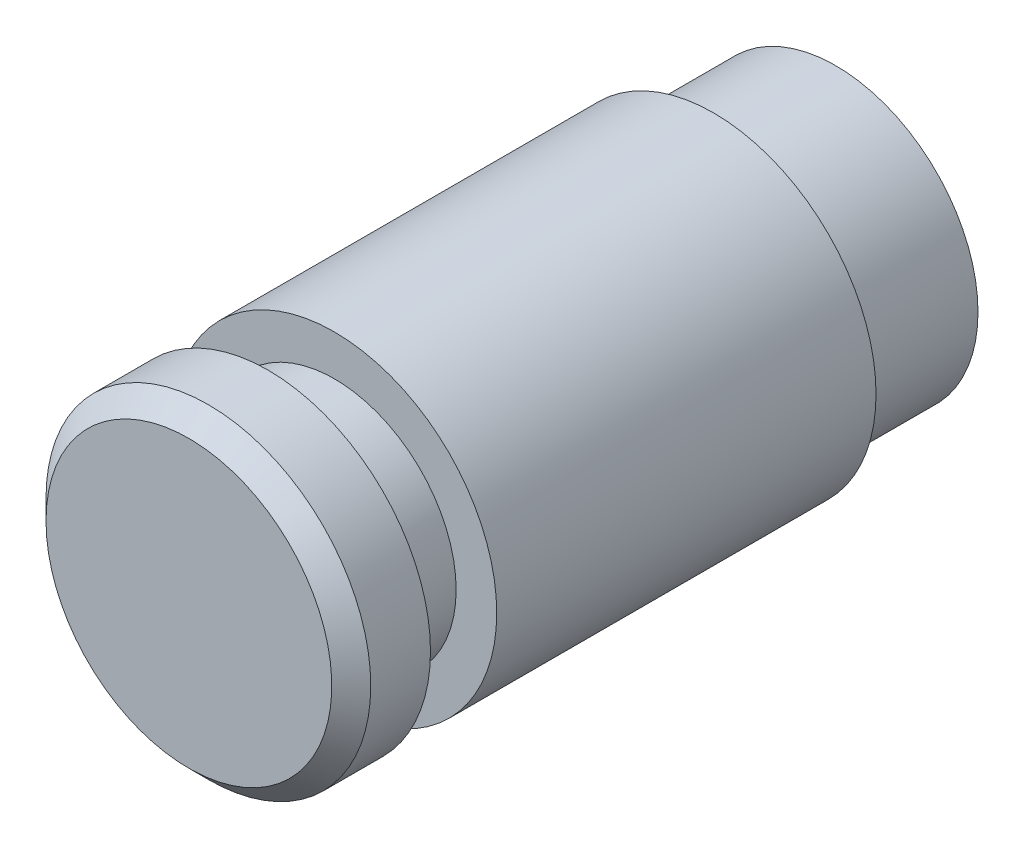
ISO-10303-21;
HEADER;
FILE_DESCRIPTION(('STEP AP214'),'2;1');
FILE_NAME('part.step','',(''),(''),'','','');
FILE_SCHEMA(('AUTOMOTIVE_DESIGN { 1 0 10303 214 1 1 1 1 }'));
ENDSEC;
DATA;
#1=APPLICATION_CONTEXT('core data for automotive mechanical design processes');
#2=APPLICATION_PROTOCOL_DEFINITION('international standard','automotive_design',2000,#1);
#3=PRODUCT_CONTEXT('',#1,'mechanical');
#4=PRODUCT('Part','Part','',(#3));
#5=PRODUCT_RELATED_PRODUCT_CATEGORY('part','',(#4));
#6=PRODUCT_DEFINITION_FORMATION('','',#4);
#7=PRODUCT_DEFINITION_CONTEXT('part definition',#1,'design');
#8=PRODUCT_DEFINITION('design','',#6,#7);
#9=PRODUCT_DEFINITION_SHAPE('','',#8);
#10=(LENGTH_UNIT() NAMED_UNIT(*) SI_UNIT(.MILLI.,.METRE.));
#11=(NAMED_UNIT(*) PLANE_ANGLE_UNIT() SI_UNIT($,.RADIAN.));
#12=(NAMED_UNIT(*) SI_UNIT($,.STERADIAN.) SOLID_ANGLE_UNIT());
#13=UNCERTAINTY_MEASURE_WITH_UNIT(LENGTH_MEASURE(1.E-05),#10,'distance_accuracy_value','');
#14=(GEOMETRIC_REPRESENTATION_CONTEXT(3) GLOBAL_UNCERTAINTY_ASSIGNED_CONTEXT((#13)) GLOBAL_UNIT_ASSIGNED_CONTEXT((#10,
#11,#12)) REPRESENTATION_CONTEXT('',''));
#15=CARTESIAN_POINT('',(0.,0.,0.));
#16=DIRECTION('',(0.,0.,1.));
#17=DIRECTION('',(1.,0.,0.));
#18=AXIS2_PLACEMENT_3D('',#15,#16,#17);
#19=CARTESIAN_POINT('',(0.,0.,-2.3876));
#20=DIRECTION('',(0.,0.,1.));
#21=DIRECTION('',(1.,0.,0.));
#22=AXIS2_PLACEMENT_3D('',#19,#20,#21);
#23=CYLINDRICAL_SURFACE('',#22,2.7813);
#24=CARTESIAN_POINT('',(0.,0.,-2.3876));
#25=DIRECTION('',(0.,0.,1.));
#26=DIRECTION('',(1.,0.,0.));
#27=AXIS2_PLACEMENT_3D('',#24,#25,#26);
#28=CIRCLE('',#27,2.7813);
#29=CARTESIAN_POINT('',(2.7813,0.,-2.3876));
#30=VERTEX_POINT('',#29);
#31=EDGE_CURVE('E44',#30,#30,#28,.T.);
#32=ORIENTED_EDGE('',*,*,#31,.T.);
#33=EDGE_LOOP('',(#32));
#34=FACE_BOUND('',#33,.T.);
#35=CARTESIAN_POINT('',(0.,0.,0.));
#36=DIRECTION('',(0.,0.,1.));
#37=DIRECTION('',(1.,0.,0.));
#38=AXIS2_PLACEMENT_3D('',#35,#36,#37);
#39=CIRCLE('',#38,2.7813);
#40=CARTESIAN_POINT('',(2.7813,0.,0.));
#41=VERTEX_POINT('',#40);
#42=EDGE_CURVE('E48',#41,#41,#39,.T.);
#43=ORIENTED_EDGE('',*,*,#42,.F.);
#44=EDGE_LOOP('',(#43));
#45=FACE_BOUND('',#44,.T.);
#46=ADVANCED_FACE('F33',(#34,#45),#23,.T.);
#47=CARTESIAN_POINT('',(0.,0.,-2.3876));
#48=DIRECTION('',(0.,0.,1.));
#49=DIRECTION('',(1.,0.,0.));
#50=AXIS2_PLACEMENT_3D('',#47,#48,#49);
#51=PLANE('',#50);
#52=ORIENTED_EDGE('',*,*,#31,.F.);
#53=EDGE_LOOP('',(#52));
#54=FACE_BOUND('',#53,.T.);
#55=ADVANCED_FACE('F84',(#54),#51,.F.);
#56=CARTESIAN_POINT('',(0.,0.,10.2616));
#57=DIRECTION('',(0.,0.,-1.));
#58=DIRECTION('',(-1.,0.,0.));
#59=AXIS2_PLACEMENT_3D('',#56,#57,#58);
#60=CYLINDRICAL_SURFACE('',#59,3.175);
#61=CARTESIAN_POINT('',(0.,0.,7.4168));
#62=DIRECTION('',(0.,0.,-1.));
#63=DIRECTION('',(-1.,0.,0.));
#64=AXIS2_PLACEMENT_3D('',#61,#62,#63);
#65=CIRCLE('',#64,3.175);
#66=CARTESIAN_POINT('',(-3.175,0.,7.4168));
#67=VERTEX_POINT('',#66);
#68=EDGE_CURVE('E62',#67,#67,#65,.T.);
#69=ORIENTED_EDGE('',*,*,#68,.T.);
#70=EDGE_LOOP('',(#69));
#71=FACE_BOUND('',#70,.T.);
#72=CARTESIAN_POINT('',(0.,0.,0.));
#73=DIRECTION('',(0.,0.,1.));
#74=DIRECTION('',(1.,0.,0.));
#75=AXIS2_PLACEMENT_3D('',#72,#73,#74);
#76=CIRCLE('',#75,3.175);
#77=CARTESIAN_POINT('',(3.175,0.,0.));
#78=VERTEX_POINT('',#77);
#79=EDGE_CURVE('E52',#78,#78,#76,.T.);
#80=ORIENTED_EDGE('',*,*,#79,.T.);
#81=EDGE_LOOP('',(#80));
#82=FACE_BOUND('',#81,.T.);
#83=ADVANCED_FACE('F74',(#71,#82),#60,.T.);
#84=CARTESIAN_POINT('',(0.,0.,0.));
#85=DIRECTION('',(0.,0.,1.));
#86=DIRECTION('',(1.,0.,0.));
#87=AXIS2_PLACEMENT_3D('',#84,#85,#86);
#88=PLANE('',#87);
#89=ORIENTED_EDGE('',*,*,#42,.T.);
#90=EDGE_LOOP('',(#89));
#91=FACE_BOUND('',#90,.T.);
#92=ORIENTED_EDGE('',*,*,#79,.F.);
#93=EDGE_LOOP('',(#92));
#94=FACE_BOUND('',#93,.T.);
#95=ADVANCED_FACE('F83',(#91,#94),#88,.F.);
#96=CARTESIAN_POINT('',(0.,3.175,8.7122));
#97=DIRECTION('',(0.,0.,1.));
#98=DIRECTION('',(1.,0.,0.));
#99=AXIS2_PLACEMENT_3D('',#96,#97,#98);
#100=PLANE('',#99);
#101=CARTESIAN_POINT('',(0.,0.,8.7122));
#102=DIRECTION('',(0.,0.,-1.));
#103=DIRECTION('',(-1.,0.,0.));
#104=AXIS2_PLACEMENT_3D('',#101,#102,#103);
#105=CIRCLE('',#104,2.38125);
#106=CARTESIAN_POINT('',(-2.38125,0.,8.7122));
#107=VERTEX_POINT('',#106);
#108=EDGE_CURVE('E56',#107,#107,#105,.T.);
#109=ORIENTED_EDGE('',*,*,#108,.F.);
#110=EDGE_LOOP('',(#109));
#111=FACE_BOUND('',#110,.T.);
#112=CARTESIAN_POINT('',(0.,0.,8.7122));
#113=DIRECTION('',(0.,0.,-1.));
#114=DIRECTION('',(-1.,0.,0.));
#115=AXIS2_PLACEMENT_3D('',#112,#113,#114);
#116=CIRCLE('',#115,3.175);
#117=CARTESIAN_POINT('',(-3.175,0.,8.7122));
#118=VERTEX_POINT('',#117);
#119=EDGE_CURVE('E65',#118,#118,#116,.T.);
#120=ORIENTED_EDGE('',*,*,#119,.T.);
#121=EDGE_LOOP('',(#120));
#122=FACE_BOUND('',#121,.T.);
#123=ADVANCED_FACE('F69',(#111,#122),#100,.F.);
#124=CARTESIAN_POINT('',(0.,0.,0.));
#125=DIRECTION('',(0.,0.,-1.));
#126=DIRECTION('',(-1.,0.,0.));
#127=AXIS2_PLACEMENT_3D('',#124,#125,#126);
#128=CYLINDRICAL_SURFACE('',#127,2.38125);
#129=CARTESIAN_POINT('',(0.,0.,7.4168));
#130=DIRECTION('',(0.,0.,-1.));
#131=DIRECTION('',(-1.,0.,0.));
#132=AXIS2_PLACEMENT_3D('',#129,#130,#131);
#133=CIRCLE('',#132,2.38125);
#134=CARTESIAN_POINT('',(-2.38125,0.,7.4168));
#135=VERTEX_POINT('',#134);
#136=EDGE_CURVE('E59',#135,#135,#133,.T.);
#137=ORIENTED_EDGE('',*,*,#136,.F.);
#138=EDGE_LOOP('',(#137));
#139=FACE_BOUND('',#138,.T.);
#140=ORIENTED_EDGE('',*,*,#108,.T.);
#141=EDGE_LOOP('',(#140));
#142=FACE_BOUND('',#141,.T.);
#143=ADVANCED_FACE('F103',(#139,#142),#128,.T.);
#144=CARTESIAN_POINT('',(0.,3.175,7.4168));
#145=DIRECTION('',(0.,0.,-1.));
#146=DIRECTION('',(-1.,0.,0.));
#147=AXIS2_PLACEMENT_3D('',#144,#145,#146);
#148=PLANE('',#147);
#149=ORIENTED_EDGE('',*,*,#68,.F.);
#150=EDGE_LOOP('',(#149));
#151=FACE_BOUND('',#150,.T.);
#152=ORIENTED_EDGE('',*,*,#136,.T.);
#153=EDGE_LOOP('',(#152));
#154=FACE_BOUND('',#153,.T.);
#155=ADVANCED_FACE('F108',(#151,#154),#148,.F.);
#156=CARTESIAN_POINT('',(0.,0.,10.2616));
#157=DIRECTION('',(0.,0.,1.));
#158=DIRECTION('',(1.,0.,0.));
#159=AXIS2_PLACEMENT_3D('',#156,#157,#158);
#160=PLANE('',#159);
#161=CARTESIAN_POINT('',(0.,0.,10.2616));
#162=DIRECTION('',(0.,0.,1.));
#163=DIRECTION('',(1.,0.,0.));
#164=AXIS2_PLACEMENT_3D('',#161,#162,#163);
#165=CIRCLE('',#164,2.794);
#166=CARTESIAN_POINT('',(-2.794,0.,10.2616));
#167=VERTEX_POINT('',#166);
#168=EDGE_CURVE('E40',#167,#167,#165,.T.);
#169=ORIENTED_EDGE('',*,*,#168,.T.);
#170=EDGE_LOOP('',(#169));
#171=FACE_BOUND('',#170,.T.);
#172=ADVANCED_FACE('F78',(#171),#160,.T.);
#173=CARTESIAN_POINT('',(0.,0.,10.2616));
#174=DIRECTION('',(0.,0.,-1.));
#175=DIRECTION('',(-1.,0.,0.));
#176=AXIS2_PLACEMENT_3D('',#173,#174,#175);
#177=CONICAL_SURFACE('',#176,2.794,0.785398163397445);
#178=CARTESIAN_POINT('',(0.,0.,9.88059999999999));
#179=DIRECTION('',(0.,0.,1.));
#180=DIRECTION('',(1.,0.,0.));
#181=AXIS2_PLACEMENT_3D('',#178,#179,#180);
#182=CIRCLE('',#181,3.175);
#183=CARTESIAN_POINT('',(-3.175,0.,9.88059999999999));
#184=VERTEX_POINT('',#183);
#185=EDGE_CURVE('E10',#184,#184,#182,.F.);
#186=CARTESIAN_POINT('',(-3.175,0.,9.88059999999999));
#187=CARTESIAN_POINT('',(-3.17103125,0.,9.88456874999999));
#188=CARTESIAN_POINT('',(-3.1670625,0.,9.88853749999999));
#189=CARTESIAN_POINT('',(-3.159125,0.,9.89647499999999));
#190=CARTESIAN_POINT('',(-3.15515625,0.,9.90044374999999));
#191=CARTESIAN_POINT('',(-3.14721875,0.,9.90838124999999));
#192=CARTESIAN_POINT('',(-3.14325,0.,9.91234999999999));
#193=CARTESIAN_POINT('',(-3.1353125,0.,9.9202875));
#194=CARTESIAN_POINT('',(-3.13134375,0.,9.92425625));
#195=CARTESIAN_POINT('',(-3.12340625,0.,9.93219374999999));
#196=CARTESIAN_POINT('',(-3.1194375,0.,9.93616249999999));
#197=CARTESIAN_POINT('',(-3.1115,0.,9.94409999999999));
#198=CARTESIAN_POINT('',(-3.10753125,0.,9.94806875));
#199=CARTESIAN_POINT('',(-3.09959375,0.,9.95600624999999));
#200=CARTESIAN_POINT('',(-3.095625,0.,9.959975));
#201=CARTESIAN_POINT('',(-3.0876875,0.,9.9679125));
#202=CARTESIAN_POINT('',(-3.08371875,0.,9.97188125));
#203=CARTESIAN_POINT('',(-3.07578125,0.,9.97981875));
#204=CARTESIAN_POINT('',(-3.0718125,0.,9.98378749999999));
#205=CARTESIAN_POINT('',(-3.063875,0.,9.991725));
#206=CARTESIAN_POINT('',(-3.05990625,0.,9.99569375));
#207=CARTESIAN_POINT('',(-3.05196875,0.,10.00363125));
#208=CARTESIAN_POINT('',(-3.048,0.,10.0076));
#209=CARTESIAN_POINT('',(-3.0400625,0.,10.0155375));
#210=CARTESIAN_POINT('',(-3.03609375,0.,10.01950625));
#211=CARTESIAN_POINT('',(-3.02815625,0.,10.02744375));
#212=CARTESIAN_POINT('',(-3.0241875,0.,10.0314125));
#213=CARTESIAN_POINT('',(-3.01625,0.,10.03935));
#214=CARTESIAN_POINT('',(-3.01228125,0.,10.04331875));
#215=CARTESIAN_POINT('',(-3.00434375,0.,10.05125625));
#216=CARTESIAN_POINT('',(-3.000375,0.,10.055225));
#217=CARTESIAN_POINT('',(-2.9924375,0.,10.0631625));
#218=CARTESIAN_POINT('',(-2.98846875,0.,10.06713125));
#219=CARTESIAN_POINT('',(-2.98053125,0.,10.07506875));
#220=CARTESIAN_POINT('',(-2.9765625,0.,10.0790375));
#221=CARTESIAN_POINT('',(-2.968625,0.,10.086975));
#222=CARTESIAN_POINT('',(-2.96465625,0.,10.09094375));
#223=CARTESIAN_POINT('',(-2.95671875,0.,10.09888125));
#224=CARTESIAN_POINT('',(-2.95275,0.,10.10285));
#225=CARTESIAN_POINT('',(-2.9448125,0.,10.1107875));
#226=CARTESIAN_POINT('',(-2.94084375,0.,10.11475625));
#227=CARTESIAN_POINT('',(-2.93290625,0.,10.12269375));
#228=CARTESIAN_POINT('',(-2.9289375,0.,10.1266625));
#229=CARTESIAN_POINT('',(-2.921,0.,10.1346));
#230=CARTESIAN_POINT('',(-2.91703125,0.,10.13856875));
#231=CARTESIAN_POINT('',(-2.90909375,0.,10.14650625));
#232=CARTESIAN_POINT('',(-2.905125,0.,10.150475));
#233=CARTESIAN_POINT('',(-2.8971875,0.,10.1584125));
#234=CARTESIAN_POINT('',(-2.89321875,0.,10.16238125));
#235=CARTESIAN_POINT('',(-2.88528125,0.,10.17031875));
#236=CARTESIAN_POINT('',(-2.8813125,0.,10.1742875));
#237=CARTESIAN_POINT('',(-2.873375,0.,10.182225));
#238=CARTESIAN_POINT('',(-2.86940625,0.,10.18619375));
#239=CARTESIAN_POINT('',(-2.86146875,0.,10.19413125));
#240=CARTESIAN_POINT('',(-2.8575,0.,10.1981));
#241=CARTESIAN_POINT('',(-2.8495625,0.,10.2060375));
#242=CARTESIAN_POINT('',(-2.84559375,0.,10.21000625));
#243=CARTESIAN_POINT('',(-2.83765625,0.,10.21794375));
#244=CARTESIAN_POINT('',(-2.8336875,0.,10.2219125));
#245=CARTESIAN_POINT('',(-2.82575,0.,10.22985));
#246=CARTESIAN_POINT('',(-2.82178125,0.,10.23381875));
#247=CARTESIAN_POINT('',(-2.81384375,0.,10.24175625));
#248=CARTESIAN_POINT('',(-2.809875,0.,10.245725));
#249=CARTESIAN_POINT('',(-2.8019375,0.,10.2536625));
#250=CARTESIAN_POINT('',(-2.79796875,0.,10.25763125));
#251=CARTESIAN_POINT('',(-2.794,0.,10.2616));
#252=B_SPLINE_CURVE_WITH_KNOTS('',3,(#186,#187,#188,#189,#190,#191,#192,#193,#194,#195,#196,
#197,#198,#199,#200,#201,#202,#203,#204,#205,#206,#207,#208,#209,#210,#211,#212,#213,#214,#215,
#216,#217,#218,#219,#220,#221,#222,#223,#224,#225,#226,#227,#228,#229,#230,#231,#232,#233,#234,
#235,#236,#237,#238,#239,#240,#241,#242,#243,#244,#245,#246,#247,#248,#249,#250,#251),
.UNSPECIFIED.,.F.,.F.,(4,2,2,2,2,2,2,2,2,2,2,2,2,2,2,2,2,2,2,2,2,2,2,2,2,2,2,2,2,2,2,2,4),(0.,
0.016837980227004,0.0336759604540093,0.0505139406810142,0.0673519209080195,0.0841899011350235,
0.101027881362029,0.117865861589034,0.134703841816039,0.151541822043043,0.168379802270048,
0.185217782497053,0.202055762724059,0.218893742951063,0.235731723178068,0.252569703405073,
0.269407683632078,0.286245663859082,0.303083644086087,0.319921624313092,0.336759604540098,
0.353597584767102,0.370435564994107,0.387273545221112,0.404111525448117,0.420949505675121,
0.437787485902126,0.454625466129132,0.471463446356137,0.488301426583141,0.505139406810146,
0.521977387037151,0.538815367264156),.UNSPECIFIED.);
#253=EDGE_CURVE('BSEAM35',#184,#167,#252,.T.);
#254=ORIENTED_EDGE('',*,*,#185,.F.);
#255=ORIENTED_EDGE('',*,*,#168,.F.);
#256=ORIENTED_EDGE('',*,*,#253,.T.);
#257=ORIENTED_EDGE('',*,*,#253,.F.);
#258=EDGE_LOOP('',(#254,#256,#255,#257));
#259=FACE_BOUND('',#258,.T.);
#260=ADVANCED_FACE('F35',(#259),#177,.T.);
#261=ORIENTED_EDGE('',*,*,#119,.F.);
#262=EDGE_LOOP('',(#261));
#263=FACE_BOUND('',#262,.T.);
#264=ORIENTED_EDGE('',*,*,#185,.T.);
#265=EDGE_LOOP('',(#264));
#266=FACE_BOUND('',#265,.T.);
#267=ADVANCED_FACE('F71',(#263,#266),#60,.T.);
#268=CLOSED_SHELL('',(#46,#55,#83,#95,#123,#143,#155,#172,#260,#267));
#269=MANIFOLD_SOLID_BREP('B2',#268);
#270=ADVANCED_BREP_SHAPE_REPRESENTATION('',(#18,#269),#14);
#271=SHAPE_DEFINITION_REPRESENTATION(#9,#270);
ENDSEC;
END-ISO-10303-21;
